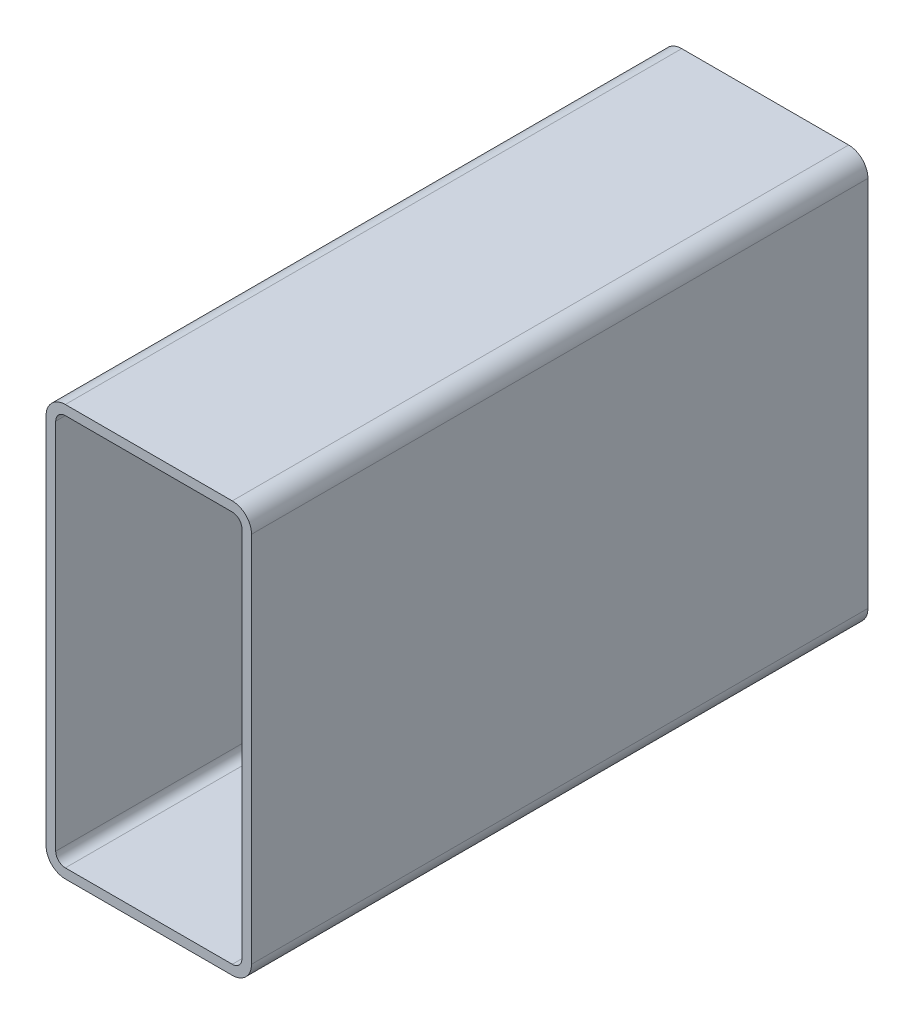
ISO-10303-21;
HEADER;
FILE_DESCRIPTION(('STEP AP214'),'2;1');
FILE_NAME('part.step','',(''),(''),'','','');
FILE_SCHEMA(('AUTOMOTIVE_DESIGN { 1 0 10303 214 1 1 1 1 }'));
ENDSEC;
DATA;
#1=APPLICATION_CONTEXT('core data for automotive mechanical design processes');
#2=APPLICATION_PROTOCOL_DEFINITION('international standard','automotive_design',2000,#1);
#3=PRODUCT_CONTEXT('',#1,'mechanical');
#4=PRODUCT('Part','Part','',(#3));
#5=PRODUCT_RELATED_PRODUCT_CATEGORY('part','',(#4));
#6=PRODUCT_DEFINITION_FORMATION('','',#4);
#7=PRODUCT_DEFINITION_CONTEXT('part definition',#1,'design');
#8=PRODUCT_DEFINITION('design','',#6,#7);
#9=PRODUCT_DEFINITION_SHAPE('','',#8);
#10=(LENGTH_UNIT() NAMED_UNIT(*) SI_UNIT(.MILLI.,.METRE.));
#11=(NAMED_UNIT(*) PLANE_ANGLE_UNIT() SI_UNIT($,.RADIAN.));
#12=(NAMED_UNIT(*) SI_UNIT($,.STERADIAN.) SOLID_ANGLE_UNIT());
#13=UNCERTAINTY_MEASURE_WITH_UNIT(LENGTH_MEASURE(1.E-05),#10,'distance_accuracy_value','');
#14=(GEOMETRIC_REPRESENTATION_CONTEXT(3) GLOBAL_UNCERTAINTY_ASSIGNED_CONTEXT((#13)) GLOBAL_UNIT_ASSIGNED_CONTEXT((#10,
#11,#12)) REPRESENTATION_CONTEXT('',''));
#15=CARTESIAN_POINT('',(0.,0.,0.));
#16=DIRECTION('',(0.,0.,1.));
#17=DIRECTION('',(1.,0.,0.));
#18=AXIS2_PLACEMENT_3D('',#15,#16,#17);
#19=CARTESIAN_POINT('',(11.2001778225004,195.641130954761,304.8));
#20=DIRECTION('',(0.,0.,1.));
#21=DIRECTION('',(1.,0.,0.));
#22=AXIS2_PLACEMENT_3D('',#19,#20,#21);
#23=PLANE('',#22);
#24=CARTESIAN_POINT('',(11.2001778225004,195.641130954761,304.8));
#25=DIRECTION('',(0.,0.,1.));
#26=DIRECTION('',(1.,0.,0.));
#27=AXIS2_PLACEMENT_3D('',#24,#25,#26);
#28=CIRCLE('',#27,9.52500000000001);
#29=CARTESIAN_POINT('',(11.2001778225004,205.166130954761,304.8));
#30=VERTEX_POINT('',#29);
#31=CARTESIAN_POINT('',(1.67517782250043,195.641130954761,304.8));
#32=VERTEX_POINT('',#31);
#33=EDGE_CURVE('E211',#30,#32,#28,.T.);
#34=ORIENTED_EDGE('',*,*,#33,.T.);
#35=DIRECTION('',(0.,-1.,0.));
#36=VECTOR('',#35,1.);
#37=CARTESIAN_POINT('',(1.67517782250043,11.4911309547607,304.8));
#38=LINE('',#37,#36);
#39=CARTESIAN_POINT('',(1.67517782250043,11.4911309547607,304.8));
#40=VERTEX_POINT('',#39);
#41=EDGE_CURVE('E214',#32,#40,#38,.T.);
#42=ORIENTED_EDGE('',*,*,#41,.T.);
#43=CARTESIAN_POINT('',(11.2001778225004,11.4911309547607,304.8));
#44=DIRECTION('',(0.,0.,1.));
#45=DIRECTION('',(1.,0.,0.));
#46=AXIS2_PLACEMENT_3D('',#43,#44,#45);
#47=CIRCLE('',#46,9.525);
#48=CARTESIAN_POINT('',(11.2001778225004,1.96613095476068,304.8));
#49=VERTEX_POINT('',#48);
#50=EDGE_CURVE('E217',#40,#49,#47,.T.);
#51=ORIENTED_EDGE('',*,*,#50,.T.);
#52=DIRECTION('',(1.,0.,0.));
#53=VECTOR('',#52,1.);
#54=CARTESIAN_POINT('',(93.7501778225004,1.96613095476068,304.8));
#55=LINE('',#54,#53);
#56=CARTESIAN_POINT('',(93.7501778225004,1.96613095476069,304.8));
#57=VERTEX_POINT('',#56);
#58=EDGE_CURVE('E219',#49,#57,#55,.T.);
#59=ORIENTED_EDGE('',*,*,#58,.T.);
#60=CARTESIAN_POINT('',(93.7501778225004,11.4911309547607,304.8));
#61=DIRECTION('',(0.,0.,1.));
#62=DIRECTION('',(1.,0.,0.));
#63=AXIS2_PLACEMENT_3D('',#60,#61,#62);
#64=CIRCLE('',#63,9.52500000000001);
#65=CARTESIAN_POINT('',(103.2751778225,11.4911309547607,304.8));
#66=VERTEX_POINT('',#65);
#67=EDGE_CURVE('E221',#57,#66,#64,.T.);
#68=ORIENTED_EDGE('',*,*,#67,.T.);
#69=DIRECTION('',(0.,1.,0.));
#70=VECTOR('',#69,1.);
#71=CARTESIAN_POINT('',(103.2751778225,195.641130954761,304.8));
#72=LINE('',#71,#70);
#73=CARTESIAN_POINT('',(103.2751778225,195.641130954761,304.8));
#74=VERTEX_POINT('',#73);
#75=EDGE_CURVE('E223',#66,#74,#72,.T.);
#76=ORIENTED_EDGE('',*,*,#75,.T.);
#77=CARTESIAN_POINT('',(93.7501778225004,195.641130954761,304.8));
#78=DIRECTION('',(0.,0.,1.));
#79=DIRECTION('',(1.,0.,0.));
#80=AXIS2_PLACEMENT_3D('',#77,#78,#79);
#81=CIRCLE('',#80,9.52500000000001);
#82=CARTESIAN_POINT('',(93.7501778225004,205.166130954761,304.8));
#83=VERTEX_POINT('',#82);
#84=EDGE_CURVE('E225',#74,#83,#81,.T.);
#85=ORIENTED_EDGE('',*,*,#84,.T.);
#86=DIRECTION('',(-1.,0.,0.));
#87=VECTOR('',#86,1.);
#88=CARTESIAN_POINT('',(11.2001778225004,205.166130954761,304.8));
#89=LINE('',#88,#87);
#90=EDGE_CURVE('E227',#83,#30,#89,.T.);
#91=ORIENTED_EDGE('',*,*,#90,.T.);
#92=EDGE_LOOP('',(#34,#42,#51,#59,#68,#76,#85,#91));
#93=FACE_BOUND('',#92,.T.);
#94=DIRECTION('',(0.,-1.,0.));
#95=VECTOR('',#94,1.);
#96=CARTESIAN_POINT('',(6.43767782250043,11.4911309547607,304.8));
#97=LINE('',#96,#95);
#98=CARTESIAN_POINT('',(6.43767782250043,195.641130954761,304.8));
#99=VERTEX_POINT('',#98);
#100=CARTESIAN_POINT('',(6.43767782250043,11.4911309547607,304.8));
#101=VERTEX_POINT('',#100);
#102=EDGE_CURVE('E154',#99,#101,#97,.T.);
#103=ORIENTED_EDGE('',*,*,#102,.F.);
#104=CARTESIAN_POINT('',(11.2001778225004,195.641130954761,304.8));
#105=DIRECTION('',(0.,0.,1.));
#106=DIRECTION('',(1.,0.,0.));
#107=AXIS2_PLACEMENT_3D('',#104,#105,#106);
#108=CIRCLE('',#107,4.76250000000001);
#109=CARTESIAN_POINT('',(11.2001778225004,200.403630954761,304.8));
#110=VERTEX_POINT('',#109);
#111=EDGE_CURVE('E146',#110,#99,#108,.T.);
#112=ORIENTED_EDGE('',*,*,#111,.F.);
#113=DIRECTION('',(-1.,0.,0.));
#114=VECTOR('',#113,1.);
#115=CARTESIAN_POINT('',(11.2001778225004,200.403630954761,304.8));
#116=LINE('',#115,#114);
#117=CARTESIAN_POINT('',(93.7501778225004,200.403630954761,304.8));
#118=VERTEX_POINT('',#117);
#119=EDGE_CURVE('E179',#118,#110,#116,.T.);
#120=ORIENTED_EDGE('',*,*,#119,.F.);
#121=CARTESIAN_POINT('',(93.7501778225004,195.641130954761,304.8));
#122=DIRECTION('',(0.,0.,1.));
#123=DIRECTION('',(1.,0.,0.));
#124=AXIS2_PLACEMENT_3D('',#121,#122,#123);
#125=CIRCLE('',#124,4.7625);
#126=CARTESIAN_POINT('',(98.5126778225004,195.641130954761,304.8));
#127=VERTEX_POINT('',#126);
#128=EDGE_CURVE('E177',#127,#118,#125,.T.);
#129=ORIENTED_EDGE('',*,*,#128,.F.);
#130=DIRECTION('',(0.,1.,0.));
#131=VECTOR('',#130,1.);
#132=CARTESIAN_POINT('',(98.5126778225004,195.641130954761,304.8));
#133=LINE('',#132,#131);
#134=CARTESIAN_POINT('',(98.5126778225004,11.4911309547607,304.8));
#135=VERTEX_POINT('',#134);
#136=EDGE_CURVE('E175',#135,#127,#133,.T.);
#137=ORIENTED_EDGE('',*,*,#136,.F.);
#138=CARTESIAN_POINT('',(93.7501778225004,11.4911309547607,304.8));
#139=DIRECTION('',(0.,0.,1.));
#140=DIRECTION('',(1.,0.,0.));
#141=AXIS2_PLACEMENT_3D('',#138,#139,#140);
#142=CIRCLE('',#141,4.7625);
#143=CARTESIAN_POINT('',(93.7501778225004,6.72863095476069,304.8));
#144=VERTEX_POINT('',#143);
#145=EDGE_CURVE('E173',#144,#135,#142,.T.);
#146=ORIENTED_EDGE('',*,*,#145,.F.);
#147=DIRECTION('',(1.,0.,0.));
#148=VECTOR('',#147,1.);
#149=CARTESIAN_POINT('',(93.7501778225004,6.72863095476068,304.8));
#150=LINE('',#149,#148);
#151=CARTESIAN_POINT('',(11.2001778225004,6.72863095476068,304.8));
#152=VERTEX_POINT('',#151);
#153=EDGE_CURVE('E169',#152,#144,#150,.T.);
#154=ORIENTED_EDGE('',*,*,#153,.F.);
#155=CARTESIAN_POINT('',(11.2001778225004,11.4911309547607,304.8));
#156=DIRECTION('',(0.,0.,1.));
#157=DIRECTION('',(1.,0.,0.));
#158=AXIS2_PLACEMENT_3D('',#155,#156,#157);
#159=CIRCLE('',#158,4.7625);
#160=EDGE_CURVE('E167',#101,#152,#159,.T.);
#161=ORIENTED_EDGE('',*,*,#160,.F.);
#162=EDGE_LOOP('',(#103,#112,#120,#129,#137,#146,#154,#161));
#163=FACE_BOUND('',#162,.T.);
#164=ADVANCED_FACE('F33',(#93,#163),#23,.T.);
#165=CARTESIAN_POINT('',(11.2001778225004,195.641130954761,0.));
#166=DIRECTION('',(0.,0.,1.));
#167=DIRECTION('',(1.,0.,0.));
#168=AXIS2_PLACEMENT_3D('',#165,#166,#167);
#169=PLANE('',#168);
#170=CARTESIAN_POINT('',(11.2001778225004,195.641130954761,0.));
#171=DIRECTION('',(0.,0.,1.));
#172=DIRECTION('',(1.,0.,0.));
#173=AXIS2_PLACEMENT_3D('',#170,#171,#172);
#174=CIRCLE('',#173,9.52500000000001);
#175=CARTESIAN_POINT('',(11.2001778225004,205.166130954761,0.));
#176=VERTEX_POINT('',#175);
#177=CARTESIAN_POINT('',(1.67517782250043,195.641130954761,0.));
#178=VERTEX_POINT('',#177);
#179=EDGE_CURVE('E162',#176,#178,#174,.T.);
#180=ORIENTED_EDGE('',*,*,#179,.F.);
#181=DIRECTION('',(-1.,0.,0.));
#182=VECTOR('',#181,1.);
#183=CARTESIAN_POINT('',(11.2001778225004,205.166130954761,0.));
#184=LINE('',#183,#182);
#185=CARTESIAN_POINT('',(93.7501778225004,205.166130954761,0.));
#186=VERTEX_POINT('',#185);
#187=EDGE_CURVE('E215',#186,#176,#184,.T.);
#188=ORIENTED_EDGE('',*,*,#187,.F.);
#189=CARTESIAN_POINT('',(93.7501778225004,195.641130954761,0.));
#190=DIRECTION('',(0.,0.,1.));
#191=DIRECTION('',(1.,0.,0.));
#192=AXIS2_PLACEMENT_3D('',#189,#190,#191);
#193=CIRCLE('',#192,9.52500000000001);
#194=CARTESIAN_POINT('',(103.2751778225,195.641130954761,0.));
#195=VERTEX_POINT('',#194);
#196=EDGE_CURVE('E242',#195,#186,#193,.T.);
#197=ORIENTED_EDGE('',*,*,#196,.F.);
#198=DIRECTION('',(0.,1.,0.));
#199=VECTOR('',#198,1.);
#200=CARTESIAN_POINT('',(103.2751778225,195.641130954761,0.));
#201=LINE('',#200,#199);
#202=CARTESIAN_POINT('',(103.2751778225,11.4911309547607,0.));
#203=VERTEX_POINT('',#202);
#204=EDGE_CURVE('E240',#203,#195,#201,.T.);
#205=ORIENTED_EDGE('',*,*,#204,.F.);
#206=CARTESIAN_POINT('',(93.7501778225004,11.4911309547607,0.));
#207=DIRECTION('',(0.,0.,1.));
#208=DIRECTION('',(1.,0.,0.));
#209=AXIS2_PLACEMENT_3D('',#206,#207,#208);
#210=CIRCLE('',#209,9.52500000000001);
#211=CARTESIAN_POINT('',(93.7501778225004,1.96613095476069,0.));
#212=VERTEX_POINT('',#211);
#213=EDGE_CURVE('E238',#212,#203,#210,.T.);
#214=ORIENTED_EDGE('',*,*,#213,.F.);
#215=DIRECTION('',(1.,0.,0.));
#216=VECTOR('',#215,1.);
#217=CARTESIAN_POINT('',(93.7501778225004,1.96613095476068,0.));
#218=LINE('',#217,#216);
#219=CARTESIAN_POINT('',(11.2001778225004,1.96613095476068,0.));
#220=VERTEX_POINT('',#219);
#221=EDGE_CURVE('E236',#220,#212,#218,.T.);
#222=ORIENTED_EDGE('',*,*,#221,.F.);
#223=CARTESIAN_POINT('',(11.2001778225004,11.4911309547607,0.));
#224=DIRECTION('',(0.,0.,1.));
#225=DIRECTION('',(1.,0.,0.));
#226=AXIS2_PLACEMENT_3D('',#223,#224,#225);
#227=CIRCLE('',#226,9.525);
#228=CARTESIAN_POINT('',(1.67517782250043,11.4911309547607,0.));
#229=VERTEX_POINT('',#228);
#230=EDGE_CURVE('E234',#229,#220,#227,.T.);
#231=ORIENTED_EDGE('',*,*,#230,.F.);
#232=DIRECTION('',(0.,-1.,0.));
#233=VECTOR('',#232,1.);
#234=CARTESIAN_POINT('',(1.67517782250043,11.4911309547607,0.));
#235=LINE('',#234,#233);
#236=EDGE_CURVE('E232',#178,#229,#235,.T.);
#237=ORIENTED_EDGE('',*,*,#236,.F.);
#238=EDGE_LOOP('',(#180,#188,#197,#205,#214,#222,#231,#237));
#239=FACE_BOUND('',#238,.T.);
#240=CARTESIAN_POINT('',(11.2001778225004,195.641130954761,0.));
#241=DIRECTION('',(0.,0.,1.));
#242=DIRECTION('',(1.,0.,0.));
#243=AXIS2_PLACEMENT_3D('',#240,#241,#242);
#244=CIRCLE('',#243,4.76250000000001);
#245=CARTESIAN_POINT('',(11.2001778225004,200.403630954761,0.));
#246=VERTEX_POINT('',#245);
#247=CARTESIAN_POINT('',(6.43767782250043,195.641130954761,0.));
#248=VERTEX_POINT('',#247);
#249=EDGE_CURVE('E56',#246,#248,#244,.T.);
#250=ORIENTED_EDGE('',*,*,#249,.T.);
#251=DIRECTION('',(0.,-1.,0.));
#252=VECTOR('',#251,1.);
#253=CARTESIAN_POINT('',(6.43767782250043,11.4911309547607,0.));
#254=LINE('',#253,#252);
#255=CARTESIAN_POINT('',(6.43767782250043,11.4911309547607,0.));
#256=VERTEX_POINT('',#255);
#257=EDGE_CURVE('E161',#248,#256,#254,.T.);
#258=ORIENTED_EDGE('',*,*,#257,.T.);
#259=CARTESIAN_POINT('',(11.2001778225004,11.4911309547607,0.));
#260=DIRECTION('',(0.,0.,1.));
#261=DIRECTION('',(1.,0.,0.));
#262=AXIS2_PLACEMENT_3D('',#259,#260,#261);
#263=CIRCLE('',#262,4.7625);
#264=CARTESIAN_POINT('',(11.2001778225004,6.72863095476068,0.));
#265=VERTEX_POINT('',#264);
#266=EDGE_CURVE('E183',#256,#265,#263,.T.);
#267=ORIENTED_EDGE('',*,*,#266,.T.);
#268=DIRECTION('',(1.,0.,0.));
#269=VECTOR('',#268,1.);
#270=CARTESIAN_POINT('',(93.7501778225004,6.72863095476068,0.));
#271=LINE('',#270,#269);
#272=CARTESIAN_POINT('',(93.7501778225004,6.72863095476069,0.));
#273=VERTEX_POINT('',#272);
#274=EDGE_CURVE('E186',#265,#273,#271,.T.);
#275=ORIENTED_EDGE('',*,*,#274,.T.);
#276=CARTESIAN_POINT('',(93.7501778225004,11.4911309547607,0.));
#277=DIRECTION('',(0.,0.,1.));
#278=DIRECTION('',(1.,0.,0.));
#279=AXIS2_PLACEMENT_3D('',#276,#277,#278);
#280=CIRCLE('',#279,4.7625);
#281=CARTESIAN_POINT('',(98.5126778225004,11.4911309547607,0.));
#282=VERTEX_POINT('',#281);
#283=EDGE_CURVE('E189',#273,#282,#280,.T.);
#284=ORIENTED_EDGE('',*,*,#283,.T.);
#285=DIRECTION('',(0.,1.,0.));
#286=VECTOR('',#285,1.);
#287=CARTESIAN_POINT('',(98.5126778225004,195.641130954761,0.));
#288=LINE('',#287,#286);
#289=CARTESIAN_POINT('',(98.5126778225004,195.641130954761,0.));
#290=VERTEX_POINT('',#289);
#291=EDGE_CURVE('E192',#282,#290,#288,.T.);
#292=ORIENTED_EDGE('',*,*,#291,.T.);
#293=CARTESIAN_POINT('',(93.7501778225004,195.641130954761,0.));
#294=DIRECTION('',(0.,0.,1.));
#295=DIRECTION('',(1.,0.,0.));
#296=AXIS2_PLACEMENT_3D('',#293,#294,#295);
#297=CIRCLE('',#296,4.7625);
#298=CARTESIAN_POINT('',(93.7501778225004,200.403630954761,0.));
#299=VERTEX_POINT('',#298);
#300=EDGE_CURVE('E195',#290,#299,#297,.T.);
#301=ORIENTED_EDGE('',*,*,#300,.T.);
#302=DIRECTION('',(-1.,0.,0.));
#303=VECTOR('',#302,1.);
#304=CARTESIAN_POINT('',(11.2001778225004,200.403630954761,0.));
#305=LINE('',#304,#303);
#306=EDGE_CURVE('E155',#299,#246,#305,.T.);
#307=ORIENTED_EDGE('',*,*,#306,.T.);
#308=EDGE_LOOP('',(#250,#258,#267,#275,#284,#292,#301,#307));
#309=FACE_BOUND('',#308,.T.);
#310=ADVANCED_FACE('F272',(#239,#309),#169,.F.);
#311=CARTESIAN_POINT('',(11.2001778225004,195.641130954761,304.8));
#312=DIRECTION('',(0.,0.,-1.));
#313=DIRECTION('',(-1.,0.,0.));
#314=AXIS2_PLACEMENT_3D('',#311,#312,#313);
#315=CYLINDRICAL_SURFACE('',#314,9.52500000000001);
#316=ORIENTED_EDGE('',*,*,#179,.T.);
#317=DIRECTION('',(0.,0.,-1.));
#318=VECTOR('',#317,1.);
#319=CARTESIAN_POINT('',(1.67517782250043,195.641130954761,304.8));
#320=LINE('',#319,#318);
#321=EDGE_CURVE('E11',#32,#178,#320,.T.);
#322=ORIENTED_EDGE('',*,*,#321,.F.);
#323=ORIENTED_EDGE('',*,*,#33,.F.);
#324=DIRECTION('',(0.,0.,-1.));
#325=VECTOR('',#324,1.);
#326=CARTESIAN_POINT('',(11.2001778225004,205.166130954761,304.8));
#327=LINE('',#326,#325);
#328=EDGE_CURVE('E229',#30,#176,#327,.T.);
#329=ORIENTED_EDGE('',*,*,#328,.T.);
#330=EDGE_LOOP('',(#316,#322,#323,#329));
#331=FACE_BOUND('',#330,.T.);
#332=ADVANCED_FACE('F35',(#331),#315,.T.);
#333=CARTESIAN_POINT('',(1.67517782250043,11.4911309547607,304.8));
#334=DIRECTION('',(1.,0.,0.));
#335=DIRECTION('',(0.,0.,-1.));
#336=AXIS2_PLACEMENT_3D('',#333,#334,#335);
#337=PLANE('',#336);
#338=ORIENTED_EDGE('',*,*,#236,.T.);
#339=DIRECTION('',(0.,0.,-1.));
#340=VECTOR('',#339,1.);
#341=CARTESIAN_POINT('',(1.67517782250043,11.4911309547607,304.8));
#342=LINE('',#341,#340);
#343=EDGE_CURVE('E41',#40,#229,#342,.T.);
#344=ORIENTED_EDGE('',*,*,#343,.F.);
#345=ORIENTED_EDGE('',*,*,#41,.F.);
#346=ORIENTED_EDGE('',*,*,#321,.T.);
#347=EDGE_LOOP('',(#338,#344,#345,#346));
#348=FACE_BOUND('',#347,.T.);
#349=ADVANCED_FACE('F289',(#348),#337,.F.);
#350=CARTESIAN_POINT('',(11.2001778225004,11.4911309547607,304.8));
#351=DIRECTION('',(0.,0.,-1.));
#352=DIRECTION('',(-1.,0.,0.));
#353=AXIS2_PLACEMENT_3D('',#350,#351,#352);
#354=CYLINDRICAL_SURFACE('',#353,9.525);
#355=ORIENTED_EDGE('',*,*,#230,.T.);
#356=DIRECTION('',(0.,0.,-1.));
#357=VECTOR('',#356,1.);
#358=CARTESIAN_POINT('',(11.2001778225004,1.96613095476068,304.8));
#359=LINE('',#358,#357);
#360=EDGE_CURVE('E259',#49,#220,#359,.T.);
#361=ORIENTED_EDGE('',*,*,#360,.F.);
#362=ORIENTED_EDGE('',*,*,#50,.F.);
#363=ORIENTED_EDGE('',*,*,#343,.T.);
#364=EDGE_LOOP('',(#355,#361,#362,#363));
#365=FACE_BOUND('',#364,.T.);
#366=ADVANCED_FACE('F266',(#365),#354,.T.);
#367=CARTESIAN_POINT('',(93.7501778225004,1.96613095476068,304.8));
#368=DIRECTION('',(0.,1.,0.));
#369=DIRECTION('',(0.,0.,1.));
#370=AXIS2_PLACEMENT_3D('',#367,#368,#369);
#371=PLANE('',#370);
#372=ORIENTED_EDGE('',*,*,#221,.T.);
#373=DIRECTION('',(0.,0.,-1.));
#374=VECTOR('',#373,1.);
#375=CARTESIAN_POINT('',(93.7501778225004,1.96613095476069,304.8));
#376=LINE('',#375,#374);
#377=EDGE_CURVE('E256',#57,#212,#376,.T.);
#378=ORIENTED_EDGE('',*,*,#377,.F.);
#379=ORIENTED_EDGE('',*,*,#58,.F.);
#380=ORIENTED_EDGE('',*,*,#360,.T.);
#381=EDGE_LOOP('',(#372,#378,#379,#380));
#382=FACE_BOUND('',#381,.T.);
#383=ADVANCED_FACE('F278',(#382),#371,.F.);
#384=CARTESIAN_POINT('',(93.7501778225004,11.4911309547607,304.8));
#385=DIRECTION('',(0.,0.,-1.));
#386=DIRECTION('',(-1.,0.,0.));
#387=AXIS2_PLACEMENT_3D('',#384,#385,#386);
#388=CYLINDRICAL_SURFACE('',#387,9.52500000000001);
#389=ORIENTED_EDGE('',*,*,#213,.T.);
#390=DIRECTION('',(0.,0.,-1.));
#391=VECTOR('',#390,1.);
#392=CARTESIAN_POINT('',(103.2751778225,11.4911309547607,304.8));
#393=LINE('',#392,#391);
#394=EDGE_CURVE('E253',#66,#203,#393,.T.);
#395=ORIENTED_EDGE('',*,*,#394,.F.);
#396=ORIENTED_EDGE('',*,*,#67,.F.);
#397=ORIENTED_EDGE('',*,*,#377,.T.);
#398=EDGE_LOOP('',(#389,#395,#396,#397));
#399=FACE_BOUND('',#398,.T.);
#400=ADVANCED_FACE('F282',(#399),#388,.T.);
#401=CARTESIAN_POINT('',(103.2751778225,195.641130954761,304.8));
#402=DIRECTION('',(-1.,0.,0.));
#403=DIRECTION('',(0.,0.,1.));
#404=AXIS2_PLACEMENT_3D('',#401,#402,#403);
#405=PLANE('',#404);
#406=ORIENTED_EDGE('',*,*,#204,.T.);
#407=DIRECTION('',(0.,0.,-1.));
#408=VECTOR('',#407,1.);
#409=CARTESIAN_POINT('',(103.2751778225,195.641130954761,304.8));
#410=LINE('',#409,#408);
#411=EDGE_CURVE('E250',#74,#195,#410,.T.);
#412=ORIENTED_EDGE('',*,*,#411,.F.);
#413=ORIENTED_EDGE('',*,*,#75,.F.);
#414=ORIENTED_EDGE('',*,*,#394,.T.);
#415=EDGE_LOOP('',(#406,#412,#413,#414));
#416=FACE_BOUND('',#415,.T.);
#417=ADVANCED_FACE('F302',(#416),#405,.F.);
#418=CARTESIAN_POINT('',(93.7501778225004,195.641130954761,304.8));
#419=DIRECTION('',(0.,0.,-1.));
#420=DIRECTION('',(-1.,0.,0.));
#421=AXIS2_PLACEMENT_3D('',#418,#419,#420);
#422=CYLINDRICAL_SURFACE('',#421,9.52500000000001);
#423=ORIENTED_EDGE('',*,*,#196,.T.);
#424=DIRECTION('',(0.,0.,-1.));
#425=VECTOR('',#424,1.);
#426=CARTESIAN_POINT('',(93.7501778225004,205.166130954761,304.8));
#427=LINE('',#426,#425);
#428=EDGE_CURVE('E247',#83,#186,#427,.T.);
#429=ORIENTED_EDGE('',*,*,#428,.F.);
#430=ORIENTED_EDGE('',*,*,#84,.F.);
#431=ORIENTED_EDGE('',*,*,#411,.T.);
#432=EDGE_LOOP('',(#423,#429,#430,#431));
#433=FACE_BOUND('',#432,.T.);
#434=ADVANCED_FACE('F300',(#433),#422,.T.);
#435=CARTESIAN_POINT('',(11.2001778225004,205.166130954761,304.8));
#436=DIRECTION('',(0.,-1.,0.));
#437=DIRECTION('',(0.,0.,-1.));
#438=AXIS2_PLACEMENT_3D('',#435,#436,#437);
#439=PLANE('',#438);
#440=ORIENTED_EDGE('',*,*,#187,.T.);
#441=ORIENTED_EDGE('',*,*,#328,.F.);
#442=ORIENTED_EDGE('',*,*,#90,.F.);
#443=ORIENTED_EDGE('',*,*,#428,.T.);
#444=EDGE_LOOP('',(#440,#441,#442,#443));
#445=FACE_BOUND('',#444,.T.);
#446=ADVANCED_FACE('F295',(#445),#439,.F.);
#447=CARTESIAN_POINT('',(11.2001778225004,195.641130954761,304.8));
#448=DIRECTION('',(0.,0.,-1.));
#449=DIRECTION('',(-1.,0.,0.));
#450=AXIS2_PLACEMENT_3D('',#447,#448,#449);
#451=CYLINDRICAL_SURFACE('',#450,4.76250000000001);
#452=ORIENTED_EDGE('',*,*,#249,.F.);
#453=DIRECTION('',(0.,0.,-1.));
#454=VECTOR('',#453,1.);
#455=CARTESIAN_POINT('',(11.2001778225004,200.403630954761,304.8));
#456=LINE('',#455,#454);
#457=EDGE_CURVE('E150',#110,#246,#456,.T.);
#458=ORIENTED_EDGE('',*,*,#457,.F.);
#459=ORIENTED_EDGE('',*,*,#111,.T.);
#460=DIRECTION('',(0.,0.,-1.));
#461=VECTOR('',#460,1.);
#462=CARTESIAN_POINT('',(6.43767782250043,195.641130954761,304.8));
#463=LINE('',#462,#461);
#464=EDGE_CURVE('E149',#99,#248,#463,.T.);
#465=ORIENTED_EDGE('',*,*,#464,.T.);
#466=EDGE_LOOP('',(#452,#458,#459,#465));
#467=FACE_BOUND('',#466,.T.);
#468=ADVANCED_FACE('F148',(#467),#451,.F.);
#469=CARTESIAN_POINT('',(6.43767782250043,11.4911309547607,304.8));
#470=DIRECTION('',(1.,0.,0.));
#471=DIRECTION('',(0.,0.,-1.));
#472=AXIS2_PLACEMENT_3D('',#469,#470,#471);
#473=PLANE('',#472);
#474=ORIENTED_EDGE('',*,*,#257,.F.);
#475=ORIENTED_EDGE('',*,*,#464,.F.);
#476=ORIENTED_EDGE('',*,*,#102,.T.);
#477=DIRECTION('',(0.,0.,-1.));
#478=VECTOR('',#477,1.);
#479=CARTESIAN_POINT('',(6.43767782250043,11.4911309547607,304.8));
#480=LINE('',#479,#478);
#481=EDGE_CURVE('E163',#101,#256,#480,.T.);
#482=ORIENTED_EDGE('',*,*,#481,.T.);
#483=EDGE_LOOP('',(#474,#475,#476,#482));
#484=FACE_BOUND('',#483,.T.);
#485=ADVANCED_FACE('F158',(#484),#473,.T.);
#486=CARTESIAN_POINT('',(11.2001778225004,11.4911309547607,304.8));
#487=DIRECTION('',(0.,0.,-1.));
#488=DIRECTION('',(-1.,0.,0.));
#489=AXIS2_PLACEMENT_3D('',#486,#487,#488);
#490=CYLINDRICAL_SURFACE('',#489,4.7625);
#491=ORIENTED_EDGE('',*,*,#266,.F.);
#492=ORIENTED_EDGE('',*,*,#481,.F.);
#493=ORIENTED_EDGE('',*,*,#160,.T.);
#494=DIRECTION('',(0.,0.,-1.));
#495=VECTOR('',#494,1.);
#496=CARTESIAN_POINT('',(11.2001778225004,6.72863095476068,304.8));
#497=LINE('',#496,#495);
#498=EDGE_CURVE('E208',#152,#265,#497,.T.);
#499=ORIENTED_EDGE('',*,*,#498,.T.);
#500=EDGE_LOOP('',(#491,#492,#493,#499));
#501=FACE_BOUND('',#500,.T.);
#502=ADVANCED_FACE('F327',(#501),#490,.F.);
#503=CARTESIAN_POINT('',(93.7501778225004,6.72863095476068,304.8));
#504=DIRECTION('',(0.,1.,0.));
#505=DIRECTION('',(0.,0.,1.));
#506=AXIS2_PLACEMENT_3D('',#503,#504,#505);
#507=PLANE('',#506);
#508=ORIENTED_EDGE('',*,*,#274,.F.);
#509=ORIENTED_EDGE('',*,*,#498,.F.);
#510=ORIENTED_EDGE('',*,*,#153,.T.);
#511=DIRECTION('',(0.,0.,-1.));
#512=VECTOR('',#511,1.);
#513=CARTESIAN_POINT('',(93.7501778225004,6.72863095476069,304.8));
#514=LINE('',#513,#512);
#515=EDGE_CURVE('E206',#144,#273,#514,.T.);
#516=ORIENTED_EDGE('',*,*,#515,.T.);
#517=EDGE_LOOP('',(#508,#509,#510,#516));
#518=FACE_BOUND('',#517,.T.);
#519=ADVANCED_FACE('F331',(#518),#507,.T.);
#520=CARTESIAN_POINT('',(93.7501778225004,11.4911309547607,304.8));
#521=DIRECTION('',(0.,0.,-1.));
#522=DIRECTION('',(-1.,0.,0.));
#523=AXIS2_PLACEMENT_3D('',#520,#521,#522);
#524=CYLINDRICAL_SURFACE('',#523,4.7625);
#525=ORIENTED_EDGE('',*,*,#283,.F.);
#526=ORIENTED_EDGE('',*,*,#515,.F.);
#527=ORIENTED_EDGE('',*,*,#145,.T.);
#528=DIRECTION('',(0.,0.,-1.));
#529=VECTOR('',#528,1.);
#530=CARTESIAN_POINT('',(98.5126778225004,11.4911309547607,304.8));
#531=LINE('',#530,#529);
#532=EDGE_CURVE('E204',#135,#282,#531,.T.);
#533=ORIENTED_EDGE('',*,*,#532,.T.);
#534=EDGE_LOOP('',(#525,#526,#527,#533));
#535=FACE_BOUND('',#534,.T.);
#536=ADVANCED_FACE('F337',(#535),#524,.F.);
#537=CARTESIAN_POINT('',(98.5126778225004,195.641130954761,304.8));
#538=DIRECTION('',(-1.,0.,0.));
#539=DIRECTION('',(0.,0.,1.));
#540=AXIS2_PLACEMENT_3D('',#537,#538,#539);
#541=PLANE('',#540);
#542=ORIENTED_EDGE('',*,*,#291,.F.);
#543=ORIENTED_EDGE('',*,*,#532,.F.);
#544=ORIENTED_EDGE('',*,*,#136,.T.);
#545=DIRECTION('',(0.,0.,-1.));
#546=VECTOR('',#545,1.);
#547=CARTESIAN_POINT('',(98.5126778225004,195.641130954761,304.8));
#548=LINE('',#547,#546);
#549=EDGE_CURVE('E202',#127,#290,#548,.T.);
#550=ORIENTED_EDGE('',*,*,#549,.T.);
#551=EDGE_LOOP('',(#542,#543,#544,#550));
#552=FACE_BOUND('',#551,.T.);
#553=ADVANCED_FACE('F341',(#552),#541,.T.);
#554=CARTESIAN_POINT('',(93.7501778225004,195.641130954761,304.8));
#555=DIRECTION('',(0.,0.,-1.));
#556=DIRECTION('',(-1.,0.,0.));
#557=AXIS2_PLACEMENT_3D('',#554,#555,#556);
#558=CYLINDRICAL_SURFACE('',#557,4.7625);
#559=ORIENTED_EDGE('',*,*,#300,.F.);
#560=ORIENTED_EDGE('',*,*,#549,.F.);
#561=ORIENTED_EDGE('',*,*,#128,.T.);
#562=DIRECTION('',(0.,0.,-1.));
#563=VECTOR('',#562,1.);
#564=CARTESIAN_POINT('',(93.7501778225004,200.403630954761,304.8));
#565=LINE('',#564,#563);
#566=EDGE_CURVE('E48',#118,#299,#565,.T.);
#567=ORIENTED_EDGE('',*,*,#566,.T.);
#568=EDGE_LOOP('',(#559,#560,#561,#567));
#569=FACE_BOUND('',#568,.T.);
#570=ADVANCED_FACE('F345',(#569),#558,.F.);
#571=CARTESIAN_POINT('',(11.2001778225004,200.403630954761,304.8));
#572=DIRECTION('',(0.,-1.,0.));
#573=DIRECTION('',(0.,0.,-1.));
#574=AXIS2_PLACEMENT_3D('',#571,#572,#573);
#575=PLANE('',#574);
#576=ORIENTED_EDGE('',*,*,#306,.F.);
#577=ORIENTED_EDGE('',*,*,#566,.F.);
#578=ORIENTED_EDGE('',*,*,#119,.T.);
#579=ORIENTED_EDGE('',*,*,#457,.T.);
#580=EDGE_LOOP('',(#576,#577,#578,#579));
#581=FACE_BOUND('',#580,.T.);
#582=ADVANCED_FACE('F349',(#581),#575,.T.);
#583=CLOSED_SHELL('',(#164,#310,#332,#349,#366,#383,#400,#417,#434,#446,#468,#485,#502,#519,
#536,#553,#570,#582));
#584=MANIFOLD_SOLID_BREP('B2',#583);
#585=ADVANCED_BREP_SHAPE_REPRESENTATION('',(#18,#584),#14);
#586=SHAPE_DEFINITION_REPRESENTATION(#9,#585);
ENDSEC;
END-ISO-10303-21;
